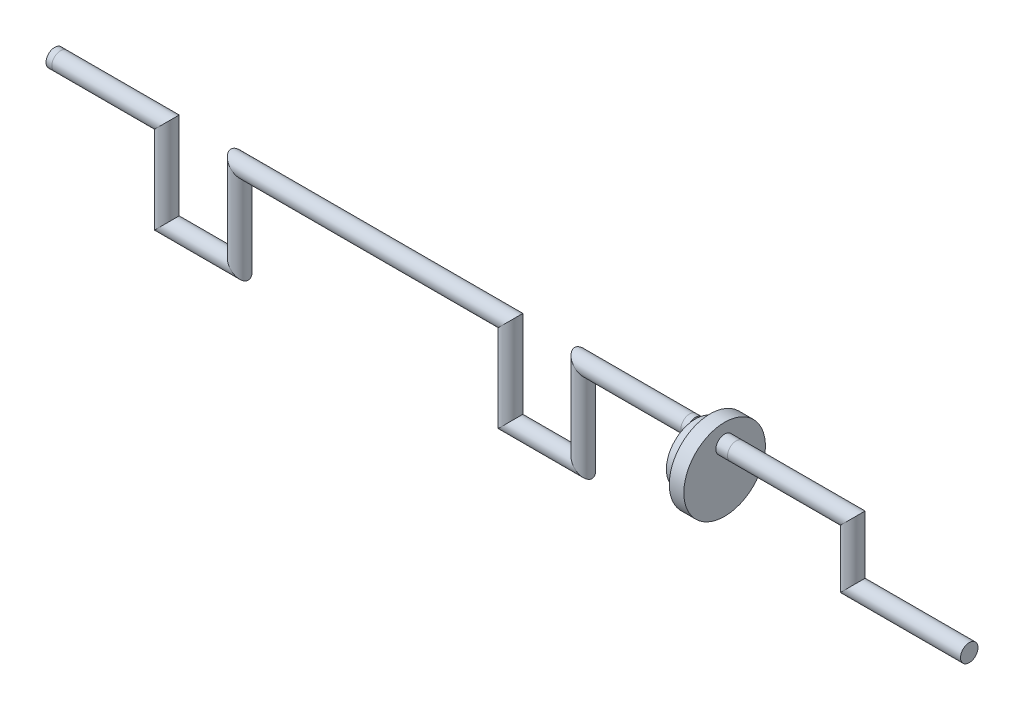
ISO-10303-21;
HEADER;
FILE_DESCRIPTION(('STEP AP214'),'2;1');
FILE_NAME('part.step','',(''),(''),'','','');
FILE_SCHEMA(('AUTOMOTIVE_DESIGN { 1 0 10303 214 1 1 1 1 }'));
ENDSEC;
DATA;
#1=APPLICATION_CONTEXT('core data for automotive mechanical design processes');
#2=APPLICATION_PROTOCOL_DEFINITION('international standard','automotive_design',2000,#1);
#3=PRODUCT_CONTEXT('',#1,'mechanical');
#4=PRODUCT('Part','Part','',(#3));
#5=PRODUCT_RELATED_PRODUCT_CATEGORY('part','',(#4));
#6=PRODUCT_DEFINITION_FORMATION('','',#4);
#7=PRODUCT_DEFINITION_CONTEXT('part definition',#1,'design');
#8=PRODUCT_DEFINITION('design','',#6,#7);
#9=PRODUCT_DEFINITION_SHAPE('','',#8);
#10=(LENGTH_UNIT() NAMED_UNIT(*) SI_UNIT(.MILLI.,.METRE.));
#11=(NAMED_UNIT(*) PLANE_ANGLE_UNIT() SI_UNIT($,.RADIAN.));
#12=(NAMED_UNIT(*) SI_UNIT($,.STERADIAN.) SOLID_ANGLE_UNIT());
#13=UNCERTAINTY_MEASURE_WITH_UNIT(LENGTH_MEASURE(1.E-05),#10,'distance_accuracy_value','');
#14=(GEOMETRIC_REPRESENTATION_CONTEXT(3) GLOBAL_UNCERTAINTY_ASSIGNED_CONTEXT((#13)) GLOBAL_UNIT_ASSIGNED_CONTEXT((#10,
#11,#12)) REPRESENTATION_CONTEXT('',''));
#15=CARTESIAN_POINT('',(0.,0.,0.));
#16=DIRECTION('',(0.,0.,1.));
#17=DIRECTION('',(1.,0.,0.));
#18=AXIS2_PLACEMENT_3D('',#15,#16,#17);
#19=CARTESIAN_POINT('',(80.,-20.,0.));
#20=DIRECTION('',(1.,0.,0.));
#21=DIRECTION('',(0.,0.,-1.));
#22=AXIS2_PLACEMENT_3D('',#19,#20,#21);
#23=PLANE('',#22);
#24=CARTESIAN_POINT('',(80.,-20.,0.));
#25=DIRECTION('',(1.,0.,0.));
#26=DIRECTION('',(0.,0.,-1.));
#27=AXIS2_PLACEMENT_3D('',#24,#25,#26);
#28=CIRCLE('',#27,3.);
#29=CARTESIAN_POINT('',(80.,-20.,-3.));
#30=VERTEX_POINT('',#29);
#31=EDGE_CURVE('E57',#30,#30,#28,.T.);
#32=ORIENTED_EDGE('',*,*,#31,.T.);
#33=EDGE_LOOP('',(#32));
#34=FACE_BOUND('',#33,.T.);
#35=ADVANCED_FACE('F37',(#34),#23,.T.);
#36=CARTESIAN_POINT('',(46.7,0.,0.));
#37=DIRECTION('',(-1.,0.,0.));
#38=DIRECTION('',(0.,0.,1.));
#39=AXIS2_PLACEMENT_3D('',#36,#37,#38);
#40=CYLINDRICAL_SURFACE('',#39,3.);
#41=CARTESIAN_POINT('',(40.,0.,0.));
#42=DIRECTION('',(-0.707106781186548,0.707106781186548,0.));
#43=DIRECTION('',(0.707106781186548,0.707106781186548,0.));
#44=AXIS2_PLACEMENT_3D('',#41,#42,#43);
#45=ELLIPSE('',#44,4.24264068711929,3.);
#46=CARTESIAN_POINT('',(43.,3.,0.));
#47=VERTEX_POINT('',#46);
#48=EDGE_CURVE('E52',#47,#47,#45,.T.);
#49=ORIENTED_EDGE('',*,*,#48,.T.);
#50=EDGE_LOOP('',(#49));
#51=FACE_BOUND('',#50,.T.);
#52=CARTESIAN_POINT('',(0.,0.,0.));
#53=DIRECTION('',(1.,0.,0.));
#54=DIRECTION('',(0.,0.,-1.));
#55=AXIS2_PLACEMENT_3D('',#52,#53,#54);
#56=CIRCLE('',#55,3.);
#57=CARTESIAN_POINT('',(0.,0.,-3.));
#58=VERTEX_POINT('',#57);
#59=EDGE_CURVE('E40',#58,#58,#56,.T.);
#60=ORIENTED_EDGE('',*,*,#59,.T.);
#61=EDGE_LOOP('',(#60));
#62=FACE_BOUND('',#61,.T.);
#63=ADVANCED_FACE('F151',(#51,#62),#40,.T.);
#64=CARTESIAN_POINT('',(0.,0.,0.));
#65=DIRECTION('',(-1.,0.,0.));
#66=DIRECTION('',(0.,-1.,0.));
#67=AXIS2_PLACEMENT_3D('',#64,#65,#66);
#68=CYLINDRICAL_SURFACE('',#67,3.);
#69=CARTESIAN_POINT('',(-4.00000000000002,0.,0.));
#70=DIRECTION('',(1.,0.,0.));
#71=DIRECTION('',(0.,0.,-1.));
#72=AXIS2_PLACEMENT_3D('',#69,#70,#71);
#73=CIRCLE('',#72,3.);
#74=CARTESIAN_POINT('',(-4.00000000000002,0.,-3.));
#75=VERTEX_POINT('',#74);
#76=EDGE_CURVE('E139',#75,#75,#73,.T.);
#77=ORIENTED_EDGE('',*,*,#76,.T.);
#78=EDGE_LOOP('',(#77));
#79=FACE_BOUND('',#78,.T.);
#80=ORIENTED_EDGE('',*,*,#59,.F.);
#81=EDGE_LOOP('',(#80));
#82=FACE_BOUND('',#81,.T.);
#83=ADVANCED_FACE('F153',(#79,#82),#68,.T.);
#84=CARTESIAN_POINT('',(40.,-26.7,0.));
#85=DIRECTION('',(0.,1.,0.));
#86=DIRECTION('',(0.,0.,1.));
#87=AXIS2_PLACEMENT_3D('',#84,#85,#86);
#88=CYLINDRICAL_SURFACE('',#87,3.);
#89=CARTESIAN_POINT('',(40.,-20.,0.));
#90=DIRECTION('',(-0.707106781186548,0.707106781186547,0.));
#91=DIRECTION('',(-0.707106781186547,-0.707106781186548,0.));
#92=AXIS2_PLACEMENT_3D('',#89,#90,#91);
#93=ELLIPSE('',#92,4.24264068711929,3.);
#94=CARTESIAN_POINT('',(37.,-23.,0.));
#95=VERTEX_POINT('',#94);
#96=EDGE_CURVE('E135',#95,#95,#93,.T.);
#97=ORIENTED_EDGE('',*,*,#96,.T.);
#98=EDGE_LOOP('',(#97));
#99=FACE_BOUND('',#98,.T.);
#100=ORIENTED_EDGE('',*,*,#48,.F.);
#101=EDGE_LOOP('',(#100));
#102=FACE_BOUND('',#101,.T.);
#103=ADVANCED_FACE('F155',(#99,#102),#88,.T.);
#104=CARTESIAN_POINT('',(80.,-20.,0.));
#105=DIRECTION('',(-1.,0.,0.));
#106=DIRECTION('',(0.,-1.,0.));
#107=AXIS2_PLACEMENT_3D('',#104,#105,#106);
#108=CYLINDRICAL_SURFACE('',#107,3.);
#109=ORIENTED_EDGE('',*,*,#31,.F.);
#110=EDGE_LOOP('',(#109));
#111=FACE_BOUND('',#110,.T.);
#112=ORIENTED_EDGE('',*,*,#96,.F.);
#113=EDGE_LOOP('',(#112));
#114=FACE_BOUND('',#113,.T.);
#115=ADVANCED_FACE('F161',(#111,#114),#108,.T.);
#116=CARTESIAN_POINT('',(-9.00000000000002,-7.5,0.));
#117=DIRECTION('',(1.,0.,0.));
#118=DIRECTION('',(0.,0.,-1.));
#119=AXIS2_PLACEMENT_3D('',#116,#117,#118);
#120=CYLINDRICAL_SURFACE('',#119,14.);
#121=CARTESIAN_POINT('',(-9.00000000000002,-7.5,0.));
#122=DIRECTION('',(-1.,0.,0.));
#123=DIRECTION('',(0.,0.,1.));
#124=AXIS2_PLACEMENT_3D('',#121,#122,#123);
#125=CIRCLE('',#124,14.);
#126=CARTESIAN_POINT('',(-9.00000000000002,-7.5,14.));
#127=VERTEX_POINT('',#126);
#128=EDGE_CURVE('E136',#127,#127,#125,.T.);
#129=ORIENTED_EDGE('',*,*,#128,.F.);
#130=EDGE_LOOP('',(#129));
#131=FACE_BOUND('',#130,.T.);
#132=CARTESIAN_POINT('',(-4.00000000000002,-7.5,0.));
#133=DIRECTION('',(-1.,0.,0.));
#134=DIRECTION('',(0.,0.,1.));
#135=AXIS2_PLACEMENT_3D('',#132,#133,#134);
#136=CIRCLE('',#135,14.);
#137=CARTESIAN_POINT('',(-4.00000000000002,-7.5,14.));
#138=VERTEX_POINT('',#137);
#139=EDGE_CURVE('E131',#138,#138,#136,.T.);
#140=ORIENTED_EDGE('',*,*,#139,.T.);
#141=EDGE_LOOP('',(#140));
#142=FACE_BOUND('',#141,.T.);
#143=ADVANCED_FACE('F166',(#131,#142),#120,.T.);
#144=CARTESIAN_POINT('',(-9.00000000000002,-7.5,0.));
#145=DIRECTION('',(-1.,0.,0.));
#146=DIRECTION('',(0.,0.,1.));
#147=AXIS2_PLACEMENT_3D('',#144,#145,#146);
#148=PLANE('',#147);
#149=CARTESIAN_POINT('',(-9.00000000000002,-7.5,0.));
#150=DIRECTION('',(-1.,0.,0.));
#151=DIRECTION('',(0.,0.,1.));
#152=AXIS2_PLACEMENT_3D('',#149,#150,#151);
#153=CIRCLE('',#152,10.);
#154=CARTESIAN_POINT('',(-9.00000000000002,-7.5,10.));
#155=VERTEX_POINT('',#154);
#156=EDGE_CURVE('E45',#155,#155,#153,.T.);
#157=ORIENTED_EDGE('',*,*,#156,.F.);
#158=EDGE_LOOP('',(#157));
#159=FACE_BOUND('',#158,.T.);
#160=ORIENTED_EDGE('',*,*,#128,.T.);
#161=EDGE_LOOP('',(#160));
#162=FACE_BOUND('',#161,.T.);
#163=ADVANCED_FACE('F171',(#159,#162),#148,.T.);
#164=CARTESIAN_POINT('',(-4.00000000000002,-7.5,0.));
#165=DIRECTION('',(-1.,0.,0.));
#166=DIRECTION('',(0.,0.,1.));
#167=AXIS2_PLACEMENT_3D('',#164,#165,#166);
#168=PLANE('',#167);
#169=ORIENTED_EDGE('',*,*,#76,.F.);
#170=EDGE_LOOP('',(#169));
#171=FACE_BOUND('',#170,.T.);
#172=ORIENTED_EDGE('',*,*,#139,.F.);
#173=EDGE_LOOP('',(#172));
#174=FACE_BOUND('',#173,.T.);
#175=ADVANCED_FACE('F176',(#171,#174),#168,.F.);
#176=CARTESIAN_POINT('',(-14.,-7.5,0.));
#177=DIRECTION('',(1.,0.,0.));
#178=DIRECTION('',(0.,0.,-1.));
#179=AXIS2_PLACEMENT_3D('',#176,#177,#178);
#180=CYLINDRICAL_SURFACE('',#179,10.);
#181=CARTESIAN_POINT('',(-14.,-7.5,0.));
#182=DIRECTION('',(-1.,0.,0.));
#183=DIRECTION('',(0.,0.,1.));
#184=AXIS2_PLACEMENT_3D('',#181,#182,#183);
#185=CIRCLE('',#184,10.);
#186=CARTESIAN_POINT('',(-14.,2.31666666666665,1.90605759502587));
#187=VERTEX_POINT('',#186);
#188=CARTESIAN_POINT('',(-14.,2.31666666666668,-1.90605759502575));
#189=VERTEX_POINT('',#188);
#190=EDGE_CURVE('E128',#187,#189,#185,.T.);
#191=ORIENTED_EDGE('',*,*,#190,.F.);
#192=EDGE_CURVE('E132',#189,#187,#185,.T.);
#193=ORIENTED_EDGE('',*,*,#192,.F.);
#194=EDGE_LOOP('',(#191,#193));
#195=FACE_BOUND('',#194,.T.);
#196=ORIENTED_EDGE('',*,*,#156,.T.);
#197=EDGE_LOOP('',(#196));
#198=FACE_BOUND('',#197,.T.);
#199=ADVANCED_FACE('F179',(#195,#198),#180,.T.);
#200=CARTESIAN_POINT('',(-14.,-7.5,0.));
#201=DIRECTION('',(-1.,0.,0.));
#202=DIRECTION('',(0.,0.,1.));
#203=AXIS2_PLACEMENT_3D('',#200,#201,#202);
#204=PLANE('',#203);
#205=CARTESIAN_POINT('',(-14.,0.,0.));
#206=DIRECTION('',(1.,0.,0.));
#207=DIRECTION('',(0.,0.,-1.));
#208=AXIS2_PLACEMENT_3D('',#205,#206,#207);
#209=CIRCLE('',#208,3.00000000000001);
#210=EDGE_CURVE('E11',#187,#189,#209,.T.);
#211=ORIENTED_EDGE('',*,*,#210,.T.);
#212=ORIENTED_EDGE('',*,*,#192,.T.);
#213=EDGE_LOOP('',(#211,#212));
#214=FACE_BOUND('',#213,.T.);
#215=ADVANCED_FACE('F186',(#214),#204,.T.);
#216=CARTESIAN_POINT('',(-234.,0.,0.));
#217=DIRECTION('',(1.,0.,0.));
#218=DIRECTION('',(0.,0.,-1.));
#219=AXIS2_PLACEMENT_3D('',#216,#217,#218);
#220=PLANE('',#219);
#221=CARTESIAN_POINT('',(-234.,0.,0.));
#222=DIRECTION('',(1.,0.,0.));
#223=DIRECTION('',(0.,0.,-1.));
#224=AXIS2_PLACEMENT_3D('',#221,#222,#223);
#225=CIRCLE('',#224,3.00000000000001);
#226=CARTESIAN_POINT('',(-234.,0.,-2.99999999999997));
#227=VERTEX_POINT('',#226);
#228=EDGE_CURVE('E124',#227,#227,#225,.T.);
#229=ORIENTED_EDGE('',*,*,#228,.F.);
#230=EDGE_LOOP('',(#229));
#231=FACE_BOUND('',#230,.T.);
#232=ADVANCED_FACE('F190',(#231),#220,.F.);
#233=CARTESIAN_POINT('',(-14.,0.,0.));
#234=DIRECTION('',(1.,0.,0.));
#235=DIRECTION('',(0.,0.,-1.));
#236=AXIS2_PLACEMENT_3D('',#233,#234,#235);
#237=PLANE('',#236);
#238=EDGE_CURVE('E47',#189,#187,#209,.T.);
#239=ORIENTED_EDGE('',*,*,#238,.T.);
#240=ORIENTED_EDGE('',*,*,#190,.T.);
#241=EDGE_LOOP('',(#239,#240));
#242=FACE_BOUND('',#241,.T.);
#243=ADVANCED_FACE('F194',(#242),#237,.T.);
#244=CARTESIAN_POINT('',(-188.8,0.,0.));
#245=DIRECTION('',(-1.,0.,0.));
#246=DIRECTION('',(0.,-1.,0.));
#247=AXIS2_PLACEMENT_3D('',#244,#245,#246);
#248=CYLINDRICAL_SURFACE('',#247,3.00000000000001);
#249=CARTESIAN_POINT('',(-195.5,0.,0.));
#250=DIRECTION('',(-0.707106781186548,0.707106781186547,0.));
#251=DIRECTION('',(0.707106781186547,0.707106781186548,0.));
#252=AXIS2_PLACEMENT_3D('',#249,#250,#251);
#253=ELLIPSE('',#252,4.2426406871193,3.00000000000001);
#254=CARTESIAN_POINT('',(-192.5,2.99999999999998,0.));
#255=VERTEX_POINT('',#254);
#256=EDGE_CURVE('E120',#255,#255,#253,.T.);
#257=ORIENTED_EDGE('',*,*,#256,.T.);
#258=EDGE_LOOP('',(#257));
#259=FACE_BOUND('',#258,.T.);
#260=CARTESIAN_POINT('',(-232.,0.,0.));
#261=DIRECTION('',(1.,0.,0.));
#262=DIRECTION('',(0.,0.,-1.));
#263=AXIS2_PLACEMENT_3D('',#260,#261,#262);
#264=CIRCLE('',#263,3.00000000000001);
#265=CARTESIAN_POINT('',(-232.,0.,-2.99999999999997));
#266=VERTEX_POINT('',#265);
#267=EDGE_CURVE('E123',#266,#266,#264,.T.);
#268=ORIENTED_EDGE('',*,*,#267,.T.);
#269=EDGE_LOOP('',(#268));
#270=FACE_BOUND('',#269,.T.);
#271=ADVANCED_FACE('F198',(#259,#270),#248,.T.);
#272=CARTESIAN_POINT('',(-232.,0.,0.));
#273=DIRECTION('',(-1.,0.,0.));
#274=DIRECTION('',(0.,-1.,0.));
#275=AXIS2_PLACEMENT_3D('',#272,#273,#274);
#276=CYLINDRICAL_SURFACE('',#275,3.00000000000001);
#277=ORIENTED_EDGE('',*,*,#228,.T.);
#278=EDGE_LOOP('',(#277));
#279=FACE_BOUND('',#278,.T.);
#280=ORIENTED_EDGE('',*,*,#267,.F.);
#281=EDGE_LOOP('',(#280));
#282=FACE_BOUND('',#281,.T.);
#283=ADVANCED_FACE('F202',(#279,#282),#276,.T.);
#284=CARTESIAN_POINT('',(-195.5,-36.7000000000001,0.));
#285=DIRECTION('',(0.,1.,0.));
#286=DIRECTION('',(-1.,0.,0.));
#287=AXIS2_PLACEMENT_3D('',#284,#285,#286);
#288=CYLINDRICAL_SURFACE('',#287,3.00000000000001);
#289=CARTESIAN_POINT('',(-195.5,-30.,0.));
#290=DIRECTION('',(-0.707106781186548,0.707106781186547,0.));
#291=DIRECTION('',(-0.707106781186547,-0.707106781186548,0.));
#292=AXIS2_PLACEMENT_3D('',#289,#290,#291);
#293=ELLIPSE('',#292,4.2426406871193,3.00000000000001);
#294=CARTESIAN_POINT('',(-198.5,-33.,0.));
#295=VERTEX_POINT('',#294);
#296=EDGE_CURVE('E117',#295,#295,#293,.T.);
#297=ORIENTED_EDGE('',*,*,#296,.T.);
#298=EDGE_LOOP('',(#297));
#299=FACE_BOUND('',#298,.T.);
#300=ORIENTED_EDGE('',*,*,#256,.F.);
#301=EDGE_LOOP('',(#300));
#302=FACE_BOUND('',#301,.T.);
#303=ADVANCED_FACE('F206',(#299,#302),#288,.T.);
#304=CARTESIAN_POINT('',(-163.8,-30.,0.));
#305=DIRECTION('',(-1.,0.,0.));
#306=DIRECTION('',(0.,-1.,0.));
#307=AXIS2_PLACEMENT_3D('',#304,#305,#306);
#308=CYLINDRICAL_SURFACE('',#307,3.00000000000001);
#309=CARTESIAN_POINT('',(-170.5,-30.0000000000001,0.));
#310=DIRECTION('',(-0.707106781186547,-0.707106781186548,0.));
#311=DIRECTION('',(0.707106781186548,-0.707106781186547,0.));
#312=AXIS2_PLACEMENT_3D('',#309,#310,#311);
#313=ELLIPSE('',#312,4.2426406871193,3.00000000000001);
#314=CARTESIAN_POINT('',(-167.5,-33.0000000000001,0.));
#315=VERTEX_POINT('',#314);
#316=EDGE_CURVE('E114',#315,#315,#313,.T.);
#317=ORIENTED_EDGE('',*,*,#316,.T.);
#318=EDGE_LOOP('',(#317));
#319=FACE_BOUND('',#318,.T.);
#320=ORIENTED_EDGE('',*,*,#296,.F.);
#321=EDGE_LOOP('',(#320));
#322=FACE_BOUND('',#321,.T.);
#323=ADVANCED_FACE('F210',(#319,#322),#308,.T.);
#324=CARTESIAN_POINT('',(-170.5,6.69999999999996,0.));
#325=DIRECTION('',(0.,-1.,0.));
#326=DIRECTION('',(0.,0.,-1.));
#327=AXIS2_PLACEMENT_3D('',#324,#325,#326);
#328=CYLINDRICAL_SURFACE('',#327,3.00000000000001);
#329=CARTESIAN_POINT('',(-170.5,0.,0.));
#330=DIRECTION('',(-0.707106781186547,-0.707106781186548,0.));
#331=DIRECTION('',(-0.707106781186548,0.707106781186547,0.));
#332=AXIS2_PLACEMENT_3D('',#329,#330,#331);
#333=ELLIPSE('',#332,4.2426406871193,3.00000000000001);
#334=CARTESIAN_POINT('',(-173.5,2.99999999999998,0.));
#335=VERTEX_POINT('',#334);
#336=EDGE_CURVE('E111',#335,#335,#333,.T.);
#337=ORIENTED_EDGE('',*,*,#336,.T.);
#338=EDGE_LOOP('',(#337));
#339=FACE_BOUND('',#338,.T.);
#340=ORIENTED_EDGE('',*,*,#316,.F.);
#341=EDGE_LOOP('',(#340));
#342=FACE_BOUND('',#341,.T.);
#343=ADVANCED_FACE('F214',(#339,#342),#328,.T.);
#344=CARTESIAN_POINT('',(-70.8,0.,0.));
#345=DIRECTION('',(-1.,0.,0.));
#346=DIRECTION('',(0.,-1.,0.));
#347=AXIS2_PLACEMENT_3D('',#344,#345,#346);
#348=CYLINDRICAL_SURFACE('',#347,3.00000000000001);
#349=CARTESIAN_POINT('',(-77.5,0.,0.));
#350=DIRECTION('',(-0.707106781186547,0.707106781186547,0.));
#351=DIRECTION('',(0.707106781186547,0.707106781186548,0.));
#352=AXIS2_PLACEMENT_3D('',#349,#350,#351);
#353=ELLIPSE('',#352,4.2426406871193,3.00000000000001);
#354=CARTESIAN_POINT('',(-74.5,2.99999999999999,0.));
#355=VERTEX_POINT('',#354);
#356=EDGE_CURVE('E108',#355,#355,#353,.T.);
#357=ORIENTED_EDGE('',*,*,#356,.T.);
#358=EDGE_LOOP('',(#357));
#359=FACE_BOUND('',#358,.T.);
#360=ORIENTED_EDGE('',*,*,#336,.F.);
#361=EDGE_LOOP('',(#360));
#362=FACE_BOUND('',#361,.T.);
#363=ADVANCED_FACE('F218',(#359,#362),#348,.T.);
#364=CARTESIAN_POINT('',(-77.5,-36.7000000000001,0.));
#365=DIRECTION('',(0.,1.,0.));
#366=DIRECTION('',(0.,0.,1.));
#367=AXIS2_PLACEMENT_3D('',#364,#365,#366);
#368=CYLINDRICAL_SURFACE('',#367,3.00000000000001);
#369=CARTESIAN_POINT('',(-77.5,-30.,0.));
#370=DIRECTION('',(-0.707106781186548,0.707106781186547,0.));
#371=DIRECTION('',(-0.707106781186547,-0.707106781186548,0.));
#372=AXIS2_PLACEMENT_3D('',#369,#370,#371);
#373=ELLIPSE('',#372,4.2426406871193,3.00000000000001);
#374=CARTESIAN_POINT('',(-80.5000000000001,-33.,0.));
#375=VERTEX_POINT('',#374);
#376=EDGE_CURVE('E103',#375,#375,#373,.T.);
#377=ORIENTED_EDGE('',*,*,#376,.T.);
#378=EDGE_LOOP('',(#377));
#379=FACE_BOUND('',#378,.T.);
#380=ORIENTED_EDGE('',*,*,#356,.F.);
#381=EDGE_LOOP('',(#380));
#382=FACE_BOUND('',#381,.T.);
#383=ADVANCED_FACE('F222',(#379,#382),#368,.T.);
#384=CARTESIAN_POINT('',(-45.8,-30.,0.));
#385=DIRECTION('',(-1.,0.,0.));
#386=DIRECTION('',(0.,-1.,0.));
#387=AXIS2_PLACEMENT_3D('',#384,#385,#386);
#388=CYLINDRICAL_SURFACE('',#387,3.00000000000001);
#389=CARTESIAN_POINT('',(-52.5,-30.,0.));
#390=DIRECTION('',(-0.707106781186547,-0.707106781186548,0.));
#391=DIRECTION('',(0.707106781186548,-0.707106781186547,0.));
#392=AXIS2_PLACEMENT_3D('',#389,#390,#391);
#393=ELLIPSE('',#392,4.2426406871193,3.00000000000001);
#394=CARTESIAN_POINT('',(-49.5,-33.,0.));
#395=VERTEX_POINT('',#394);
#396=EDGE_CURVE('E98',#395,#395,#393,.T.);
#397=ORIENTED_EDGE('',*,*,#396,.T.);
#398=EDGE_LOOP('',(#397));
#399=FACE_BOUND('',#398,.T.);
#400=ORIENTED_EDGE('',*,*,#376,.F.);
#401=EDGE_LOOP('',(#400));
#402=FACE_BOUND('',#401,.T.);
#403=ADVANCED_FACE('F226',(#399,#402),#388,.T.);
#404=CARTESIAN_POINT('',(-52.5,6.70000000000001,0.));
#405=DIRECTION('',(0.,-1.,0.));
#406=DIRECTION('',(1.,0.,0.));
#407=AXIS2_PLACEMENT_3D('',#404,#405,#406);
#408=CYLINDRICAL_SURFACE('',#407,3.00000000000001);
#409=CARTESIAN_POINT('',(-52.5,0.,0.));
#410=DIRECTION('',(-0.707106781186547,-0.707106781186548,0.));
#411=DIRECTION('',(-0.707106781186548,0.707106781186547,0.));
#412=AXIS2_PLACEMENT_3D('',#409,#410,#411);
#413=ELLIPSE('',#412,4.2426406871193,3.00000000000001);
#414=CARTESIAN_POINT('',(-55.5,2.99999999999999,0.));
#415=VERTEX_POINT('',#414);
#416=EDGE_CURVE('E94',#415,#415,#413,.T.);
#417=ORIENTED_EDGE('',*,*,#416,.T.);
#418=EDGE_LOOP('',(#417));
#419=FACE_BOUND('',#418,.T.);
#420=ORIENTED_EDGE('',*,*,#396,.F.);
#421=EDGE_LOOP('',(#420));
#422=FACE_BOUND('',#421,.T.);
#423=ADVANCED_FACE('F230',(#419,#422),#408,.T.);
#424=CARTESIAN_POINT('',(-14.,0.,0.));
#425=DIRECTION('',(-1.,0.,0.));
#426=DIRECTION('',(0.,-1.,0.));
#427=AXIS2_PLACEMENT_3D('',#424,#425,#426);
#428=CYLINDRICAL_SURFACE('',#427,3.00000000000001);
#429=CARTESIAN_POINT('',(-16.,0.,0.));
#430=DIRECTION('',(1.,0.,0.));
#431=DIRECTION('',(0.,0.,-1.));
#432=AXIS2_PLACEMENT_3D('',#429,#430,#431);
#433=CIRCLE('',#432,3.00000000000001);
#434=CARTESIAN_POINT('',(-16.,0.,-2.99999999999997));
#435=VERTEX_POINT('',#434);
#436=EDGE_CURVE('E97',#435,#435,#433,.T.);
#437=ORIENTED_EDGE('',*,*,#436,.T.);
#438=EDGE_LOOP('',(#437));
#439=FACE_BOUND('',#438,.T.);
#440=ORIENTED_EDGE('',*,*,#238,.F.);
#441=ORIENTED_EDGE('',*,*,#210,.F.);
#442=EDGE_LOOP('',(#440,#441));
#443=FACE_BOUND('',#442,.T.);
#444=ADVANCED_FACE('F234',(#439,#443),#428,.T.);
#445=CARTESIAN_POINT('',(-16.,0.,0.));
#446=DIRECTION('',(-1.,0.,0.));
#447=DIRECTION('',(0.,-1.,0.));
#448=AXIS2_PLACEMENT_3D('',#445,#446,#447);
#449=CYLINDRICAL_SURFACE('',#448,3.00000000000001);
#450=ORIENTED_EDGE('',*,*,#436,.F.);
#451=EDGE_LOOP('',(#450));
#452=FACE_BOUND('',#451,.T.);
#453=ORIENTED_EDGE('',*,*,#416,.F.);
#454=EDGE_LOOP('',(#453));
#455=FACE_BOUND('',#454,.T.);
#456=ADVANCED_FACE('F95',(#452,#455),#449,.T.);
#457=CLOSED_SHELL('',(#35,#63,#83,#103,#115,#143,#163,#175,#199,#215,#232,#243,#271,#283,#303,
#323,#343,#363,#383,#403,#423,#444,#456));
#458=MANIFOLD_SOLID_BREP('B2',#457);
#459=ADVANCED_BREP_SHAPE_REPRESENTATION('',(#18,#458),#14);
#460=SHAPE_DEFINITION_REPRESENTATION(#9,#459);
ENDSEC;
END-ISO-10303-21;
